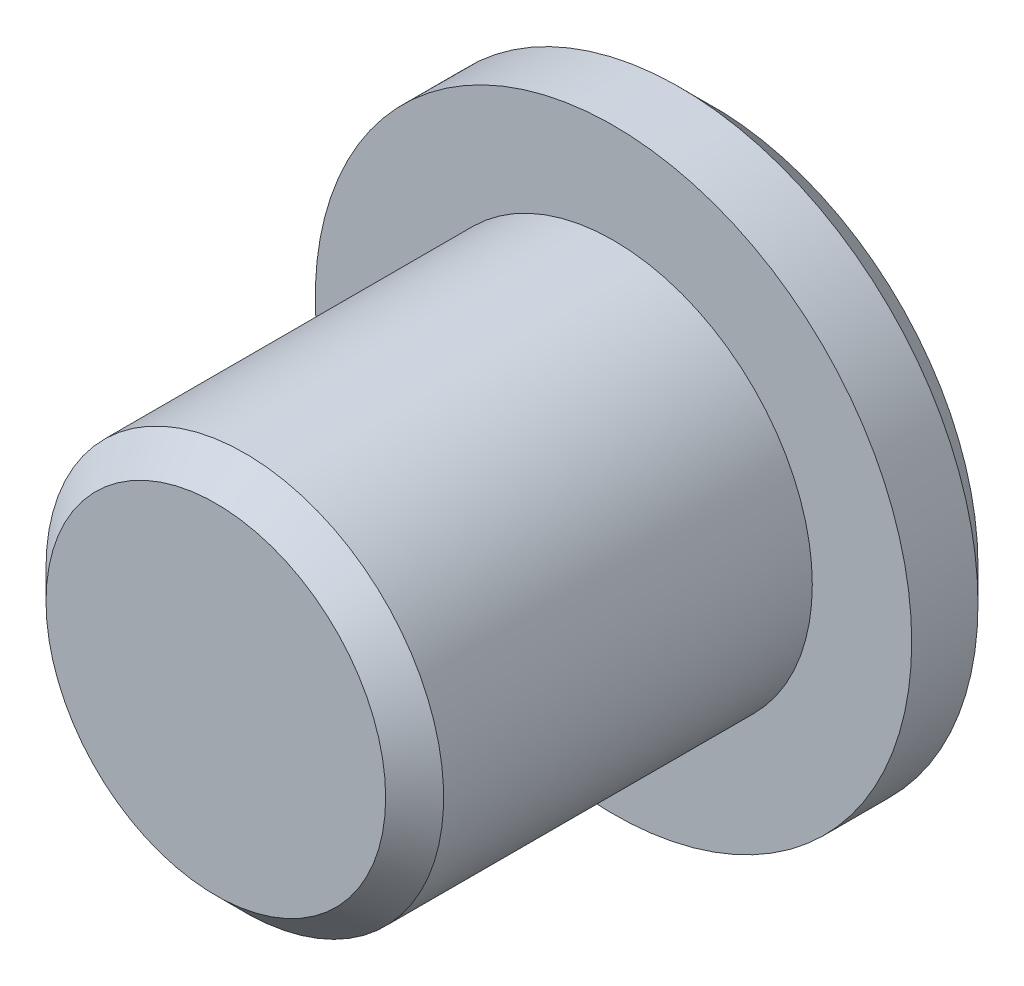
ISO-10303-21;
HEADER;
FILE_DESCRIPTION(('STEP AP214'),'2;1');
FILE_NAME('part.step','',(''),(''),'','','');
FILE_SCHEMA(('AUTOMOTIVE_DESIGN { 1 0 10303 214 1 1 1 1 }'));
ENDSEC;
DATA;
#1=APPLICATION_CONTEXT('core data for automotive mechanical design processes');
#2=APPLICATION_PROTOCOL_DEFINITION('international standard','automotive_design',2000,#1);
#3=PRODUCT_CONTEXT('',#1,'mechanical');
#4=PRODUCT('Part','Part','',(#3));
#5=PRODUCT_RELATED_PRODUCT_CATEGORY('part','',(#4));
#6=PRODUCT_DEFINITION_FORMATION('','',#4);
#7=PRODUCT_DEFINITION_CONTEXT('part definition',#1,'design');
#8=PRODUCT_DEFINITION('design','',#6,#7);
#9=PRODUCT_DEFINITION_SHAPE('','',#8);
#10=(LENGTH_UNIT() NAMED_UNIT(*) SI_UNIT(.MILLI.,.METRE.));
#11=(NAMED_UNIT(*) PLANE_ANGLE_UNIT() SI_UNIT($,.RADIAN.));
#12=(NAMED_UNIT(*) SI_UNIT($,.STERADIAN.) SOLID_ANGLE_UNIT());
#13=UNCERTAINTY_MEASURE_WITH_UNIT(LENGTH_MEASURE(1.E-05),#10,'distance_accuracy_value','');
#14=(GEOMETRIC_REPRESENTATION_CONTEXT(3) GLOBAL_UNCERTAINTY_ASSIGNED_CONTEXT((#13)) GLOBAL_UNIT_ASSIGNED_CONTEXT((#10,
#11,#12)) REPRESENTATION_CONTEXT('',''));
#15=CARTESIAN_POINT('',(0.,0.,0.));
#16=DIRECTION('',(0.,0.,1.));
#17=DIRECTION('',(1.,0.,0.));
#18=AXIS2_PLACEMENT_3D('',#15,#16,#17);
#19=CARTESIAN_POINT('',(0.,0.,0.));
#20=DIRECTION('',(0.,0.,1.));
#21=DIRECTION('',(1.,0.,0.));
#22=AXIS2_PLACEMENT_3D('',#19,#20,#21);
#23=PLANE('',#22);
#24=CARTESIAN_POINT('',(0.,0.,0.));
#25=DIRECTION('',(0.,0.,1.));
#26=DIRECTION('',(1.,0.,0.));
#27=AXIS2_PLACEMENT_3D('',#24,#25,#26);
#28=CIRCLE('',#27,8.);
#29=CARTESIAN_POINT('',(8.,0.,0.));
#30=VERTEX_POINT('',#29);
#31=EDGE_CURVE('E45',#30,#30,#28,.F.);
#32=ORIENTED_EDGE('',*,*,#31,.T.);
#33=EDGE_LOOP('',(#32));
#34=FACE_BOUND('',#33,.T.);
#35=CARTESIAN_POINT('',(0.,0.,0.));
#36=DIRECTION('',(0.,0.,-1.));
#37=DIRECTION('',(-1.,0.,0.));
#38=AXIS2_PLACEMENT_3D('',#35,#36,#37);
#39=CIRCLE('',#38,3.46410161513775);
#40=CARTESIAN_POINT('',(3.46410161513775,0.,0.));
#41=VERTEX_POINT('',#40);
#42=CARTESIAN_POINT('',(1.73205080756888,-3.,0.));
#43=VERTEX_POINT('',#42);
#44=EDGE_CURVE('E152',#41,#43,#39,.T.);
#45=ORIENTED_EDGE('',*,*,#44,.F.);
#46=CARTESIAN_POINT('',(1.73205080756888,3.,0.));
#47=VERTEX_POINT('',#46);
#48=EDGE_CURVE('E151',#47,#41,#39,.T.);
#49=ORIENTED_EDGE('',*,*,#48,.F.);
#50=CARTESIAN_POINT('',(-1.73205080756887,3.,0.));
#51=VERTEX_POINT('',#50);
#52=EDGE_CURVE('E119',#51,#47,#39,.T.);
#53=ORIENTED_EDGE('',*,*,#52,.F.);
#54=CARTESIAN_POINT('',(-3.46410161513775,0.,0.));
#55=VERTEX_POINT('',#54);
#56=EDGE_CURVE('E111',#55,#51,#39,.T.);
#57=ORIENTED_EDGE('',*,*,#56,.F.);
#58=CARTESIAN_POINT('',(-1.73205080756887,-3.,0.));
#59=VERTEX_POINT('',#58);
#60=EDGE_CURVE('E51',#59,#55,#39,.T.);
#61=ORIENTED_EDGE('',*,*,#60,.F.);
#62=EDGE_CURVE('E58',#43,#59,#39,.T.);
#63=ORIENTED_EDGE('',*,*,#62,.F.);
#64=EDGE_LOOP('',(#45,#49,#53,#57,#61,#63));
#65=FACE_BOUND('',#64,.T.);
#66=ADVANCED_FACE('F32',(#34,#65),#23,.F.);
#67=CARTESIAN_POINT('',(0.,0.,3.));
#68=DIRECTION('',(0.,0.,1.));
#69=DIRECTION('',(1.,0.,0.));
#70=AXIS2_PLACEMENT_3D('',#67,#68,#69);
#71=PLANE('',#70);
#72=CARTESIAN_POINT('',(0.,0.,3.));
#73=DIRECTION('',(0.,0.,1.));
#74=DIRECTION('',(1.,0.,0.));
#75=AXIS2_PLACEMENT_3D('',#72,#73,#74);
#76=CIRCLE('',#75,9.);
#77=CARTESIAN_POINT('',(9.,0.,3.));
#78=VERTEX_POINT('',#77);
#79=EDGE_CURVE('E244',#78,#78,#76,.T.);
#80=ORIENTED_EDGE('',*,*,#79,.T.);
#81=EDGE_LOOP('',(#80));
#82=FACE_BOUND('',#81,.T.);
#83=CARTESIAN_POINT('',(0.,0.,3.));
#84=DIRECTION('',(0.,0.,1.));
#85=DIRECTION('',(1.,0.,0.));
#86=AXIS2_PLACEMENT_3D('',#83,#84,#85);
#87=CIRCLE('',#86,6.);
#88=CARTESIAN_POINT('',(6.,0.,3.));
#89=VERTEX_POINT('',#88);
#90=EDGE_CURVE('E249',#89,#89,#87,.T.);
#91=ORIENTED_EDGE('',*,*,#90,.F.);
#92=EDGE_LOOP('',(#91));
#93=FACE_BOUND('',#92,.T.);
#94=ADVANCED_FACE('F211',(#82,#93),#71,.T.);
#95=CARTESIAN_POINT('',(0.,0.,3.));
#96=DIRECTION('',(0.,0.,-1.));
#97=DIRECTION('',(-1.,0.,0.));
#98=AXIS2_PLACEMENT_3D('',#95,#96,#97);
#99=CYLINDRICAL_SURFACE('',#98,9.);
#100=CARTESIAN_POINT('',(0.,0.,0.999999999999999));
#101=DIRECTION('',(0.,0.,1.));
#102=DIRECTION('',(1.,0.,0.));
#103=AXIS2_PLACEMENT_3D('',#100,#101,#102);
#104=CIRCLE('',#103,9.);
#105=CARTESIAN_POINT('',(9.,0.,0.999999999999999));
#106=VERTEX_POINT('',#105);
#107=EDGE_CURVE('E246',#106,#106,#104,.T.);
#108=ORIENTED_EDGE('',*,*,#107,.T.);
#109=EDGE_LOOP('',(#108));
#110=FACE_BOUND('',#109,.T.);
#111=ORIENTED_EDGE('',*,*,#79,.F.);
#112=EDGE_LOOP('',(#111));
#113=FACE_BOUND('',#112,.T.);
#114=ADVANCED_FACE('F217',(#110,#113),#99,.T.);
#115=CARTESIAN_POINT('',(0.,0.,15.));
#116=DIRECTION('',(0.,0.,-1.));
#117=DIRECTION('',(-1.,0.,0.));
#118=AXIS2_PLACEMENT_3D('',#115,#116,#117);
#119=CYLINDRICAL_SURFACE('',#118,6.);
#120=CARTESIAN_POINT('',(0.,0.,14.125));
#121=DIRECTION('',(0.,0.,1.));
#122=DIRECTION('',(1.,0.,0.));
#123=AXIS2_PLACEMENT_3D('',#120,#121,#122);
#124=CIRCLE('',#123,6.);
#125=CARTESIAN_POINT('',(-6.,0.,14.125));
#126=VERTEX_POINT('',#125);
#127=EDGE_CURVE('E240',#126,#126,#124,.F.);
#128=ORIENTED_EDGE('',*,*,#127,.T.);
#129=EDGE_LOOP('',(#128));
#130=FACE_BOUND('',#129,.T.);
#131=ORIENTED_EDGE('',*,*,#90,.T.);
#132=EDGE_LOOP('',(#131));
#133=FACE_BOUND('',#132,.T.);
#134=ADVANCED_FACE('F224',(#130,#133),#119,.T.);
#135=CARTESIAN_POINT('',(0.,0.,15.));
#136=DIRECTION('',(0.,0.,1.));
#137=DIRECTION('',(1.,0.,0.));
#138=AXIS2_PLACEMENT_3D('',#135,#136,#137);
#139=PLANE('',#138);
#140=CARTESIAN_POINT('',(0.,0.,15.));
#141=DIRECTION('',(0.,0.,1.));
#142=DIRECTION('',(1.,0.,0.));
#143=AXIS2_PLACEMENT_3D('',#140,#141,#142);
#144=CIRCLE('',#143,5.125);
#145=CARTESIAN_POINT('',(-5.125,0.,15.));
#146=VERTEX_POINT('',#145);
#147=EDGE_CURVE('E243',#146,#146,#144,.T.);
#148=ORIENTED_EDGE('',*,*,#147,.T.);
#149=EDGE_LOOP('',(#148));
#150=FACE_BOUND('',#149,.T.);
#151=ADVANCED_FACE('F228',(#150),#139,.T.);
#152=CARTESIAN_POINT('',(0.,0.,15.));
#153=DIRECTION('',(0.,0.,-1.));
#154=DIRECTION('',(-1.,0.,0.));
#155=AXIS2_PLACEMENT_3D('',#152,#153,#154);
#156=CONICAL_SURFACE('',#155,5.125,0.785398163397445);
#157=CARTESIAN_POINT('',(-6.,0.,14.125));
#158=CARTESIAN_POINT('',(-5.99088541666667,0.,14.1341145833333));
#159=CARTESIAN_POINT('',(-5.98177083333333,0.,14.1432291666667));
#160=CARTESIAN_POINT('',(-5.96354166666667,0.,14.1614583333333));
#161=CARTESIAN_POINT('',(-5.95442708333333,0.,14.1705729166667));
#162=CARTESIAN_POINT('',(-5.93619791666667,0.,14.1888020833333));
#163=CARTESIAN_POINT('',(-5.92708333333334,0.,14.1979166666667));
#164=CARTESIAN_POINT('',(-5.90885416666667,0.,14.2161458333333));
#165=CARTESIAN_POINT('',(-5.89973958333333,0.,14.2252604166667));
#166=CARTESIAN_POINT('',(-5.88151041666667,0.,14.2434895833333));
#167=CARTESIAN_POINT('',(-5.87239583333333,0.,14.2526041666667));
#168=CARTESIAN_POINT('',(-5.85416666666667,0.,14.2708333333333));
#169=CARTESIAN_POINT('',(-5.84505208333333,0.,14.2799479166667));
#170=CARTESIAN_POINT('',(-5.82682291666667,0.,14.2981770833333));
#171=CARTESIAN_POINT('',(-5.81770833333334,0.,14.3072916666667));
#172=CARTESIAN_POINT('',(-5.79947916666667,0.,14.3255208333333));
#173=CARTESIAN_POINT('',(-5.79036458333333,0.,14.3346354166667));
#174=CARTESIAN_POINT('',(-5.77213541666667,0.,14.3528645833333));
#175=CARTESIAN_POINT('',(-5.76302083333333,0.,14.3619791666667));
#176=CARTESIAN_POINT('',(-5.74479166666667,0.,14.3802083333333));
#177=CARTESIAN_POINT('',(-5.73567708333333,0.,14.3893229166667));
#178=CARTESIAN_POINT('',(-5.71744791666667,0.,14.4075520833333));
#179=CARTESIAN_POINT('',(-5.70833333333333,0.,14.4166666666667));
#180=CARTESIAN_POINT('',(-5.69010416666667,0.,14.4348958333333));
#181=CARTESIAN_POINT('',(-5.68098958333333,0.,14.4440104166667));
#182=CARTESIAN_POINT('',(-5.66276041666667,0.,14.4622395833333));
#183=CARTESIAN_POINT('',(-5.65364583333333,0.,14.4713541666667));
#184=CARTESIAN_POINT('',(-5.63541666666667,0.,14.4895833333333));
#185=CARTESIAN_POINT('',(-5.62630208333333,0.,14.4986979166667));
#186=CARTESIAN_POINT('',(-5.60807291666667,0.,14.5169270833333));
#187=CARTESIAN_POINT('',(-5.59895833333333,0.,14.5260416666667));
#188=CARTESIAN_POINT('',(-5.58072916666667,0.,14.5442708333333));
#189=CARTESIAN_POINT('',(-5.57161458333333,0.,14.5533854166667));
#190=CARTESIAN_POINT('',(-5.55338541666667,0.,14.5716145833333));
#191=CARTESIAN_POINT('',(-5.54427083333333,0.,14.5807291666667));
#192=CARTESIAN_POINT('',(-5.52604166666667,0.,14.5989583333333));
#193=CARTESIAN_POINT('',(-5.51692708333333,0.,14.6080729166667));
#194=CARTESIAN_POINT('',(-5.49869791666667,0.,14.6263020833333));
#195=CARTESIAN_POINT('',(-5.48958333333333,0.,14.6354166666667));
#196=CARTESIAN_POINT('',(-5.47135416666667,0.,14.6536458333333));
#197=CARTESIAN_POINT('',(-5.46223958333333,0.,14.6627604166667));
#198=CARTESIAN_POINT('',(-5.44401041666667,0.,14.6809895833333));
#199=CARTESIAN_POINT('',(-5.43489583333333,0.,14.6901041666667));
#200=CARTESIAN_POINT('',(-5.41666666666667,0.,14.7083333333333));
#201=CARTESIAN_POINT('',(-5.40755208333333,0.,14.7174479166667));
#202=CARTESIAN_POINT('',(-5.38932291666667,0.,14.7356770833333));
#203=CARTESIAN_POINT('',(-5.38020833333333,0.,14.7447916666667));
#204=CARTESIAN_POINT('',(-5.36197916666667,0.,14.7630208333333));
#205=CARTESIAN_POINT('',(-5.35286458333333,0.,14.7721354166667));
#206=CARTESIAN_POINT('',(-5.33463541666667,0.,14.7903645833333));
#207=CARTESIAN_POINT('',(-5.32552083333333,0.,14.7994791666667));
#208=CARTESIAN_POINT('',(-5.30729166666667,0.,14.8177083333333));
#209=CARTESIAN_POINT('',(-5.29817708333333,0.,14.8268229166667));
#210=CARTESIAN_POINT('',(-5.27994791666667,0.,14.8450520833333));
#211=CARTESIAN_POINT('',(-5.27083333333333,0.,14.8541666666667));
#212=CARTESIAN_POINT('',(-5.25260416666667,0.,14.8723958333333));
#213=CARTESIAN_POINT('',(-5.24348958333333,0.,14.8815104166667));
#214=CARTESIAN_POINT('',(-5.22526041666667,0.,14.8997395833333));
#215=CARTESIAN_POINT('',(-5.21614583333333,0.,14.9088541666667));
#216=CARTESIAN_POINT('',(-5.19791666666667,0.,14.9270833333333));
#217=CARTESIAN_POINT('',(-5.18880208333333,0.,14.9361979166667));
#218=CARTESIAN_POINT('',(-5.17057291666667,0.,14.9544270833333));
#219=CARTESIAN_POINT('',(-5.16145833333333,0.,14.9635416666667));
#220=CARTESIAN_POINT('',(-5.14322916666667,0.,14.9817708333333));
#221=CARTESIAN_POINT('',(-5.13411458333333,0.,14.9908854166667));
#222=CARTESIAN_POINT('',(-5.125,0.,15.));
#223=B_SPLINE_CURVE_WITH_KNOTS('',3,(#157,#158,#159,#160,#161,#162,#163,#164,#165,#166,#167,
#168,#169,#170,#171,#172,#173,#174,#175,#176,#177,#178,#179,#180,#181,#182,#183,#184,#185,#186,
#187,#188,#189,#190,#191,#192,#193,#194,#195,#196,#197,#198,#199,#200,#201,#202,#203,#204,#205,
#206,#207,#208,#209,#210,#211,#212,#213,#214,#215,#216,#217,#218,#219,#220,#221,#222),
.UNSPECIFIED.,.F.,.F.,(4,2,2,2,2,2,2,2,2,2,2,2,2,2,2,2,2,2,2,2,2,2,2,2,2,2,2,2,2,2,2,2,4),(0.,
0.0386699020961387,0.0773398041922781,0.116009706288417,0.154679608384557,0.193349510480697,
0.232019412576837,0.270689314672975,0.309359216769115,0.348029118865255,0.386699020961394,
0.425368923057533,0.464038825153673,0.502708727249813,0.541378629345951,0.580048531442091,
0.618718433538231,0.657388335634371,0.69605823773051,0.734728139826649,0.773398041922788,
0.812067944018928,0.850737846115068,0.889407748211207,0.928077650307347,0.966747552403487,
1.00541745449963,1.04408735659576,1.0827572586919,1.12142716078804,1.16009706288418,
1.19876696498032,1.23743686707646),.UNSPECIFIED.);
#224=EDGE_CURVE('BSEAM226',#126,#146,#223,.T.);
#225=ORIENTED_EDGE('',*,*,#127,.F.);
#226=ORIENTED_EDGE('',*,*,#147,.F.);
#227=ORIENTED_EDGE('',*,*,#224,.T.);
#228=ORIENTED_EDGE('',*,*,#224,.F.);
#229=EDGE_LOOP('',(#225,#227,#226,#228));
#230=FACE_BOUND('',#229,.T.);
#231=ADVANCED_FACE('F226',(#230),#156,.T.);
#232=CARTESIAN_POINT('',(0.,0.,0.999999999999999));
#233=DIRECTION('',(0.,0.,1.));
#234=DIRECTION('',(1.,0.,0.));
#235=AXIS2_PLACEMENT_3D('',#232,#233,#234);
#236=CONICAL_SURFACE('',#235,9.,0.78539816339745);
#237=ORIENTED_EDGE('',*,*,#31,.F.);
#238=EDGE_LOOP('',(#237));
#239=FACE_BOUND('',#238,.T.);
#240=ORIENTED_EDGE('',*,*,#107,.F.);
#241=EDGE_LOOP('',(#240));
#242=FACE_BOUND('',#241,.T.);
#243=ADVANCED_FACE('F34',(#239,#242),#236,.T.);
#244=CARTESIAN_POINT('',(0.,0.,3.46410161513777));
#245=DIRECTION('',(0.,0.,-1.));
#246=DIRECTION('',(-1.,0.,0.));
#247=AXIS2_PLACEMENT_3D('',#244,#245,#246);
#248=CONICAL_SURFACE('',#247,0.,0.785398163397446);
#249=CARTESIAN_POINT('',(-3.45441625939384,3.,-1.11115703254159));
#250=CARTESIAN_POINT('',(-3.37030502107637,3.,-1.04766572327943));
#251=CARTESIAN_POINT('',(-3.28572284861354,3.,-0.984788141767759));
#252=CARTESIAN_POINT('',(-3.11543086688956,3.,-0.860535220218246));
#253=CARTESIAN_POINT('',(-3.02972077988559,3.,-0.799160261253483));
#254=CARTESIAN_POINT('',(-2.85636023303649,3.,-0.677750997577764));
#255=CARTESIAN_POINT('',(-2.76869988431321,3.,-0.617730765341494));
#256=CARTESIAN_POINT('',(-2.5918912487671,3.,-0.499930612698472));
#257=CARTESIAN_POINT('',(-2.50274306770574,3.,-0.442150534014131));
#258=CARTESIAN_POINT('',(-2.31756329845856,3.,-0.326095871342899));
#259=CARTESIAN_POINT('',(-2.22143002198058,3.,-0.267982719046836));
#260=CARTESIAN_POINT('',(-2.02694739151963,3.,-0.15559687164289));
#261=CARTESIAN_POINT('',(-1.92859833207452,3.,-0.101323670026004));
#262=CARTESIAN_POINT('',(-1.7296520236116,3.,0.00223755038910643));
#263=CARTESIAN_POINT('',(-1.62906211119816,3.,0.0515395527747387));
#264=CARTESIAN_POINT('',(-1.42513893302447,3.,0.144045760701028));
#265=CARTESIAN_POINT('',(-1.3218069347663,3.,0.187252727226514));
#266=CARTESIAN_POINT('',(-1.12067434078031,3.,0.262860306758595));
#267=CARTESIAN_POINT('',(-1.02309778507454,3.,0.295850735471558));
#268=CARTESIAN_POINT('',(-0.825595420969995,3.,0.354003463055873));
#269=CARTESIAN_POINT('',(-0.725669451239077,3.,0.379165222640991));
#270=CARTESIAN_POINT('',(-0.525726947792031,3.,0.419928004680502));
#271=CARTESIAN_POINT('',(-0.425744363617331,3.,0.435692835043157));
#272=CARTESIAN_POINT('',(-0.224710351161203,3.,0.457355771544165));
#273=CARTESIAN_POINT('',(-0.123659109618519,3.,0.46325557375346));
#274=CARTESIAN_POINT('',(0.0748582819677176,3.,0.464750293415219));
#275=CARTESIAN_POINT('',(0.172321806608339,3.,0.460710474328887));
#276=CARTESIAN_POINT('',(0.366414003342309,3.,0.443354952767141));
#277=CARTESIAN_POINT('',(0.463042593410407,3.,0.430038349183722));
#278=CARTESIAN_POINT('',(0.656399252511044,3.,0.394629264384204));
#279=CARTESIAN_POINT('',(0.753099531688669,3.,0.372387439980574));
#280=CARTESIAN_POINT('',(0.944393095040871,3.,0.320314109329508));
#281=CARTESIAN_POINT('',(1.03898655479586,3.,0.290483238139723));
#282=CARTESIAN_POINT('',(1.2346396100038,3.,0.221388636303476));
#283=CARTESIAN_POINT('',(1.33547771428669,3.,0.181504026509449));
#284=CARTESIAN_POINT('',(1.5345213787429,3.,0.095616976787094));
#285=CARTESIAN_POINT('',(1.63272604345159,3.,0.0496124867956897));
#286=CARTESIAN_POINT('',(1.82700394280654,3.,-0.0474277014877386));
#287=CARTESIAN_POINT('',(1.92306904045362,3.,-0.0984795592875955));
#288=CARTESIAN_POINT('',(2.11298650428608,3.,-0.204482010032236));
#289=CARTESIAN_POINT('',(2.20683926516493,3.,-0.259431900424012));
#290=CARTESIAN_POINT('',(2.38800606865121,3.,-0.369652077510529));
#291=CARTESIAN_POINT('',(2.47541308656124,3.,-0.424770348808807));
#292=CARTESIAN_POINT('',(2.64872655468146,3.,-0.537324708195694));
#293=CARTESIAN_POINT('',(2.73463289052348,3.,-0.594760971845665));
#294=CARTESIAN_POINT('',(2.90444477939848,3.,-0.711062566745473));
#295=CARTESIAN_POINT('',(2.98836091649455,3.,-0.769912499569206));
#296=CARTESIAN_POINT('',(3.15504638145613,3.,-0.889168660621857));
#297=CARTESIAN_POINT('',(3.23781601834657,3.,-0.949574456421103));
#298=CARTESIAN_POINT('',(3.32010556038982,3.,-1.01061635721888));
#299=B_SPLINE_CURVE_WITH_KNOTS('',3,(#249,#250,#251,#252,#253,#254,#255,#256,#257,#258,#259,
#260,#261,#262,#263,#264,#265,#266,#267,#268,#269,#270,#271,#272,#273,#274,#275,#276,#277,#278,
#279,#280,#281,#282,#283,#284,#285,#286,#287,#288,#289,#290,#291,#292,#293,#294,#295,#296,#297,
#298),.UNSPECIFIED.,.F.,.F.,(4,2,2,2,2,2,2,2,2,2,2,2,2,2,2,2,2,2,2,2,2,2,2,2,4),(0.,
0.316159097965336,0.632397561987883,0.951086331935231,1.26975254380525,1.60668135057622,
1.94356563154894,2.27947417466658,2.61523006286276,2.92396665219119,3.23272450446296,
3.5359294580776,3.83908227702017,4.13126225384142,4.42347061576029,4.72078712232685,
5.01807875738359,5.34314370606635,5.668317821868,5.99456896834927,6.32076146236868,
6.630721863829,6.94070578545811,7.24817167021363,7.55555300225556),.UNSPECIFIED.);
#300=EDGE_CURVE('E11',#47,#51,#299,.F.);
#301=ORIENTED_EDGE('',*,*,#300,.T.);
#302=ORIENTED_EDGE('',*,*,#52,.T.);
#303=EDGE_LOOP('',(#301,#302));
#304=FACE_BOUND('',#303,.T.);
#305=ADVANCED_FACE('F124',(#304),#248,.F.);
#306=CARTESIAN_POINT('',(3.46421708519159,-0.000199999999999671,-0.000115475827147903));
#307=CARTESIAN_POINT('',(3.40467869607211,0.102923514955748,0.0593716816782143));
#308=CARTESIAN_POINT('',(3.3441447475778,0.20777138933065,0.115365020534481));
#309=CARTESIAN_POINT('',(3.22070940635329,0.421567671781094,0.217887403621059));
#310=CARTESIAN_POINT('',(3.15779627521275,0.530536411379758,0.26435940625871));
#311=CARTESIAN_POINT('',(3.03093496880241,0.750266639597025,0.343966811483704));
#312=CARTESIAN_POINT('',(2.96701910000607,0.860972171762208,0.377302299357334));
#313=CARTESIAN_POINT('',(2.83778025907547,1.08482041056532,0.428662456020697));
#314=CARTESIAN_POINT('',(2.7724612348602,1.19795627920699,0.4467254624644));
#315=CARTESIAN_POINT('',(2.65988677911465,1.39294095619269,0.463023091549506));
#316=CARTESIAN_POINT('',(2.61277673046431,1.47453795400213,0.465435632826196));
#317=CARTESIAN_POINT('',(2.51863325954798,1.63759922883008,0.46137056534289));
#318=CARTESIAN_POINT('',(2.47159986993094,1.71906344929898,0.454889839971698));
#319=CARTESIAN_POINT('',(2.37797867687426,1.88122011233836,0.433408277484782));
#320=CARTESIAN_POINT('',(2.3313914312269,1.96191158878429,0.418397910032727));
#321=CARTESIAN_POINT('',(2.23901705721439,2.12190869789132,0.380676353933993));
#322=CARTESIAN_POINT('',(2.1932298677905,2.20121443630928,0.357965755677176));
#323=CARTESIAN_POINT('',(2.11194373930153,2.34200614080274,0.311239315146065));
#324=CARTESIAN_POINT('',(2.07626488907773,2.40380372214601,0.288451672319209));
#325=CARTESIAN_POINT('',(2.00554773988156,2.52628941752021,0.23920371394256));
#326=CARTESIAN_POINT('',(1.97050946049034,2.5869774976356,0.212743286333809));
#327=CARTESIAN_POINT('',(1.90118383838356,2.70705299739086,0.156743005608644));
#328=CARTESIAN_POINT('',(1.86689452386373,2.76644383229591,0.127212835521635));
#329=CARTESIAN_POINT('',(1.79895094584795,2.88412556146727,0.0654609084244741));
#330=CARTESIAN_POINT('',(1.76529630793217,2.94241710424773,0.0332408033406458));
#331=CARTESIAN_POINT('',(1.73193533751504,3.0002,-0.000115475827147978));
#332=B_SPLINE_CURVE_WITH_KNOTS('',3,(#306,#307,#308,#309,#310,#311,#312,#313,#314,#315,#316,
#317,#318,#319,#320,#321,#322,#323,#324,#325,#326,#327,#328,#329,#330,#331),.UNSPECIFIED.,.F.,
.F.,(4,2,2,2,2,2,2,2,2,2,2,2,4),(0.,0.399603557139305,0.801535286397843,1.19708369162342,
1.59163620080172,1.87398941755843,2.15644160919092,2.43921001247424,2.72195674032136,
2.94657516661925,3.17120044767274,3.3951375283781,3.61893808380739),.UNSPECIFIED.);
#333=EDGE_CURVE('E118',#41,#47,#332,.T.);
#334=ORIENTED_EDGE('',*,*,#333,.T.);
#335=ORIENTED_EDGE('',*,*,#48,.T.);
#336=EDGE_LOOP('',(#334,#335));
#337=FACE_BOUND('',#336,.T.);
#338=ADVANCED_FACE('F445',(#337),#248,.F.);
#339=CARTESIAN_POINT('',(1.73193533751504,-3.0002,-0.000115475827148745));
#340=CARTESIAN_POINT('',(1.79147372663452,-2.89707648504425,0.0593716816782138));
#341=CARTESIAN_POINT('',(1.85200767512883,-2.79222861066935,0.115365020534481));
#342=CARTESIAN_POINT('',(1.97544301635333,-2.57843232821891,0.217887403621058));
#343=CARTESIAN_POINT('',(2.03835614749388,-2.46946358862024,0.264359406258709));
#344=CARTESIAN_POINT('',(2.16521745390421,-2.24973336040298,0.343966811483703));
#345=CARTESIAN_POINT('',(2.22913332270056,-2.13902782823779,0.377302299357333));
#346=CARTESIAN_POINT('',(2.35837216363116,-1.91517958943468,0.428662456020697));
#347=CARTESIAN_POINT('',(2.42369118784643,-1.80204372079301,0.4467254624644));
#348=CARTESIAN_POINT('',(2.53626564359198,-1.6070590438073,0.463023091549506));
#349=CARTESIAN_POINT('',(2.58337569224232,-1.52546204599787,0.465435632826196));
#350=CARTESIAN_POINT('',(2.67751916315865,-1.36240077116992,0.46137056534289));
#351=CARTESIAN_POINT('',(2.72455255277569,-1.28093655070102,0.454889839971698));
#352=CARTESIAN_POINT('',(2.81817374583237,-1.11877988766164,0.433408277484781));
#353=CARTESIAN_POINT('',(2.86476099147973,-1.03808841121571,0.418397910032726));
#354=CARTESIAN_POINT('',(2.95713536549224,-0.878091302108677,0.380676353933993));
#355=CARTESIAN_POINT('',(3.00292255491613,-0.798785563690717,0.357965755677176));
#356=CARTESIAN_POINT('',(3.0842086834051,-0.65799385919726,0.311239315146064));
#357=CARTESIAN_POINT('',(3.1198875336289,-0.596196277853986,0.288451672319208));
#358=CARTESIAN_POINT('',(3.19060468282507,-0.473710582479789,0.239203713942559));
#359=CARTESIAN_POINT('',(3.22564296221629,-0.413022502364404,0.212743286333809));
#360=CARTESIAN_POINT('',(3.29496858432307,-0.292947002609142,0.156743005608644));
#361=CARTESIAN_POINT('',(3.3292578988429,-0.233556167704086,0.127212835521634));
#362=CARTESIAN_POINT('',(3.39720147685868,-0.115874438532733,0.0654609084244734));
#363=CARTESIAN_POINT('',(3.43085611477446,-0.0575828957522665,0.033240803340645));
#364=CARTESIAN_POINT('',(3.46421708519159,0.00020000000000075,-0.000115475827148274));
#365=B_SPLINE_CURVE_WITH_KNOTS('',3,(#339,#340,#341,#342,#343,#344,#345,#346,#347,#348,#349,
#350,#351,#352,#353,#354,#355,#356,#357,#358,#359,#360,#361,#362,#363,#364),.UNSPECIFIED.,.F.,
.F.,(4,2,2,2,2,2,2,2,2,2,2,2,4),(0.,0.399603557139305,0.801535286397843,1.19708369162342,
1.59163620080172,1.87398941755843,2.15644160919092,2.43921001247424,2.72195674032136,
2.94657516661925,3.17120044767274,3.3951375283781,3.61893808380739),.UNSPECIFIED.);
#366=EDGE_CURVE('E159',#43,#41,#365,.T.);
#367=ORIENTED_EDGE('',*,*,#366,.T.);
#368=ORIENTED_EDGE('',*,*,#44,.T.);
#369=EDGE_LOOP('',(#367,#368));
#370=FACE_BOUND('',#369,.T.);
#371=ADVANCED_FACE('F452',(#370),#248,.F.);
#372=CARTESIAN_POINT('',(-3.45441625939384,-3.,-1.11115703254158));
#373=CARTESIAN_POINT('',(-3.37030502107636,-3.,-1.04766572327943));
#374=CARTESIAN_POINT('',(-3.28572284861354,-3.,-0.984788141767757));
#375=CARTESIAN_POINT('',(-3.11543086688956,-3.,-0.860535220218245));
#376=CARTESIAN_POINT('',(-3.02972077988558,-3.,-0.799160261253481));
#377=CARTESIAN_POINT('',(-2.85636023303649,-3.,-0.677750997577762));
#378=CARTESIAN_POINT('',(-2.76869988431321,-3.,-0.617730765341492));
#379=CARTESIAN_POINT('',(-2.5918912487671,-3.,-0.49993061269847));
#380=CARTESIAN_POINT('',(-2.50274306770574,-3.,-0.44215053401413));
#381=CARTESIAN_POINT('',(-2.31756329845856,-3.,-0.326095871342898));
#382=CARTESIAN_POINT('',(-2.22143002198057,-3.,-0.267982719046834));
#383=CARTESIAN_POINT('',(-2.02694739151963,-3.,-0.155596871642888));
#384=CARTESIAN_POINT('',(-1.92859833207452,-3.,-0.101323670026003));
#385=CARTESIAN_POINT('',(-1.72965202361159,-3.,0.00223755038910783));
#386=CARTESIAN_POINT('',(-1.62906211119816,-3.,0.0515395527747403));
#387=CARTESIAN_POINT('',(-1.42513893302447,-3.,0.14404576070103));
#388=CARTESIAN_POINT('',(-1.3218069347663,-3.,0.187252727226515));
#389=CARTESIAN_POINT('',(-1.12067434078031,-3.,0.262860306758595));
#390=CARTESIAN_POINT('',(-1.02309778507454,-3.,0.295850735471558));
#391=CARTESIAN_POINT('',(-0.825595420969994,-3.,0.354003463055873));
#392=CARTESIAN_POINT('',(-0.725669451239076,-3.,0.379165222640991));
#393=CARTESIAN_POINT('',(-0.52572694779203,-3.,0.419928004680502));
#394=CARTESIAN_POINT('',(-0.425744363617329,-3.,0.435692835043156));
#395=CARTESIAN_POINT('',(-0.224710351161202,-3.,0.457355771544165));
#396=CARTESIAN_POINT('',(-0.123659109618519,-3.,0.46325557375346));
#397=CARTESIAN_POINT('',(0.0748582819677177,-3.,0.464750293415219));
#398=CARTESIAN_POINT('',(0.172321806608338,-3.,0.460710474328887));
#399=CARTESIAN_POINT('',(0.366414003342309,-3.,0.44335495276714));
#400=CARTESIAN_POINT('',(0.463042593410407,-3.,0.430038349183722));
#401=CARTESIAN_POINT('',(0.656399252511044,-3.,0.394629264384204));
#402=CARTESIAN_POINT('',(0.753099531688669,-3.,0.372387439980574));
#403=CARTESIAN_POINT('',(0.944393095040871,-3.,0.320314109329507));
#404=CARTESIAN_POINT('',(1.03898655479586,-3.,0.290483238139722));
#405=CARTESIAN_POINT('',(1.2346396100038,-3.,0.221388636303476));
#406=CARTESIAN_POINT('',(1.3354777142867,-3.,0.181504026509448));
#407=CARTESIAN_POINT('',(1.5345213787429,-3.,0.0956169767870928));
#408=CARTESIAN_POINT('',(1.63272604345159,-3.,0.0496124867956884));
#409=CARTESIAN_POINT('',(1.82700394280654,-3.,-0.0474277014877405));
#410=CARTESIAN_POINT('',(1.92306904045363,-3.,-0.0984795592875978));
#411=CARTESIAN_POINT('',(2.11298650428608,-3.,-0.204482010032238));
#412=CARTESIAN_POINT('',(2.20683926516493,-3.,-0.259431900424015));
#413=CARTESIAN_POINT('',(2.38800606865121,-3.,-0.369652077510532));
#414=CARTESIAN_POINT('',(2.47541308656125,-3.,-0.42477034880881));
#415=CARTESIAN_POINT('',(2.64872655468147,-3.,-0.537324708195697));
#416=CARTESIAN_POINT('',(2.73463289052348,-3.,-0.594760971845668));
#417=CARTESIAN_POINT('',(2.90444477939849,-3.,-0.711062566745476));
#418=CARTESIAN_POINT('',(2.98836091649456,-3.,-0.769912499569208));
#419=CARTESIAN_POINT('',(3.15504638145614,-3.,-0.889168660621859));
#420=CARTESIAN_POINT('',(3.23781601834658,-3.,-0.949574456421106));
#421=CARTESIAN_POINT('',(3.32010556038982,-3.,-1.01061635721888));
#422=B_SPLINE_CURVE_WITH_KNOTS('',3,(#372,#373,#374,#375,#376,#377,#378,#379,#380,#381,#382,
#383,#384,#385,#386,#387,#388,#389,#390,#391,#392,#393,#394,#395,#396,#397,#398,#399,#400,#401,
#402,#403,#404,#405,#406,#407,#408,#409,#410,#411,#412,#413,#414,#415,#416,#417,#418,#419,#420,
#421),.UNSPECIFIED.,.F.,.F.,(4,2,2,2,2,2,2,2,2,2,2,2,2,2,2,2,2,2,2,2,2,2,2,2,4),(0.,
0.316159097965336,0.632397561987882,0.951086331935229,1.26975254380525,1.60668135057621,
1.94356563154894,2.27947417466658,2.61523006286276,2.92396665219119,3.23272450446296,
3.5359294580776,3.83908227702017,4.13126225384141,4.42347061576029,4.72078712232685,
5.01807875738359,5.34314370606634,5.668317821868,5.99456896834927,6.32076146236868,
6.630721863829,6.94070578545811,7.24817167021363,7.55555300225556),.UNSPECIFIED.);
#423=EDGE_CURVE('E179',#59,#43,#422,.T.);
#424=ORIENTED_EDGE('',*,*,#423,.T.);
#425=ORIENTED_EDGE('',*,*,#62,.T.);
#426=EDGE_LOOP('',(#424,#425));
#427=FACE_BOUND('',#426,.T.);
#428=ADVANCED_FACE('F460',(#427),#248,.F.);
#429=CARTESIAN_POINT('',(-3.4642170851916,0.000199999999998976,-0.000115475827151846));
#430=CARTESIAN_POINT('',(-3.40467869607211,-0.102923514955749,0.05937168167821));
#431=CARTESIAN_POINT('',(-3.3441447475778,-0.207771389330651,0.115365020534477));
#432=CARTESIAN_POINT('',(-3.2207094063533,-0.421567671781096,0.217887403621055));
#433=CARTESIAN_POINT('',(-3.15779627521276,-0.530536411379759,0.264359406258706));
#434=CARTESIAN_POINT('',(-3.03093496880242,-0.750266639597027,0.3439668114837));
#435=CARTESIAN_POINT('',(-2.96701910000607,-0.86097217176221,0.37730229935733));
#436=CARTESIAN_POINT('',(-2.83778025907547,-1.08482041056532,0.428662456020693));
#437=CARTESIAN_POINT('',(-2.7724612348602,-1.19795627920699,0.446725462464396));
#438=CARTESIAN_POINT('',(-2.65988677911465,-1.3929409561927,0.463023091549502));
#439=CARTESIAN_POINT('',(-2.61277673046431,-1.47453795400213,0.465435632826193));
#440=CARTESIAN_POINT('',(-2.51863325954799,-1.63759922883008,0.461370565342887));
#441=CARTESIAN_POINT('',(-2.47159986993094,-1.71906344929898,0.454889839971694));
#442=CARTESIAN_POINT('',(-2.37797867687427,-1.88122011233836,0.433408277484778));
#443=CARTESIAN_POINT('',(-2.3313914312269,-1.96191158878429,0.418397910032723));
#444=CARTESIAN_POINT('',(-2.23901705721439,-2.12190869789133,0.38067635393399));
#445=CARTESIAN_POINT('',(-2.1932298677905,-2.20121443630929,0.357965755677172));
#446=CARTESIAN_POINT('',(-2.11194373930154,-2.34200614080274,0.311239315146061));
#447=CARTESIAN_POINT('',(-2.07626488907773,-2.40380372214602,0.288451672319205));
#448=CARTESIAN_POINT('',(-2.00554773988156,-2.52628941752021,0.239203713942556));
#449=CARTESIAN_POINT('',(-1.97050946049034,-2.5869774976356,0.212743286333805));
#450=CARTESIAN_POINT('',(-1.90118383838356,-2.70705299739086,0.15674300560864));
#451=CARTESIAN_POINT('',(-1.86689452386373,-2.76644383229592,0.127212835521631));
#452=CARTESIAN_POINT('',(-1.79895094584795,-2.88412556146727,0.0654609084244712));
#453=CARTESIAN_POINT('',(-1.76529630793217,-2.94241710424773,0.033240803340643));
#454=CARTESIAN_POINT('',(-1.73193533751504,-3.0002,-0.000115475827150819));
#455=B_SPLINE_CURVE_WITH_KNOTS('',3,(#429,#430,#431,#432,#433,#434,#435,#436,#437,#438,#439,
#440,#441,#442,#443,#444,#445,#446,#447,#448,#449,#450,#451,#452,#453,#454),.UNSPECIFIED.,.F.,
.F.,(4,2,2,2,2,2,2,2,2,2,2,2,4),(0.,0.399603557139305,0.801535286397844,1.19708369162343,
1.59163620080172,1.87398941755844,2.15644160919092,2.43921001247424,2.72195674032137,
2.94657516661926,3.17120044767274,3.3951375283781,3.61893808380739),.UNSPECIFIED.);
#456=EDGE_CURVE('E140',#55,#59,#455,.T.);
#457=ORIENTED_EDGE('',*,*,#456,.T.);
#458=ORIENTED_EDGE('',*,*,#60,.T.);
#459=EDGE_LOOP('',(#457,#458));
#460=FACE_BOUND('',#459,.T.);
#461=ADVANCED_FACE('F171',(#460),#248,.F.);
#462=CARTESIAN_POINT('',(-1.73193533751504,3.0002,-0.000115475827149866));
#463=CARTESIAN_POINT('',(-1.79147372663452,2.89707648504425,0.0593716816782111));
#464=CARTESIAN_POINT('',(-1.85200767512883,2.79222861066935,0.115365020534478));
#465=CARTESIAN_POINT('',(-1.97544301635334,2.57843232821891,0.217887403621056));
#466=CARTESIAN_POINT('',(-2.03835614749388,2.46946358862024,0.264359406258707));
#467=CARTESIAN_POINT('',(-2.16521745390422,2.24973336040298,0.343966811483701));
#468=CARTESIAN_POINT('',(-2.22913332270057,2.13902782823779,0.377302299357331));
#469=CARTESIAN_POINT('',(-2.35837216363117,1.91517958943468,0.428662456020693));
#470=CARTESIAN_POINT('',(-2.42369118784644,1.80204372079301,0.446725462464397));
#471=CARTESIAN_POINT('',(-2.53626564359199,1.6070590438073,0.463023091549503));
#472=CARTESIAN_POINT('',(-2.58337569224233,1.52546204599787,0.465435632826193));
#473=CARTESIAN_POINT('',(-2.67751916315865,1.36240077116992,0.461370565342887));
#474=CARTESIAN_POINT('',(-2.72455255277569,1.28093655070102,0.454889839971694));
#475=CARTESIAN_POINT('',(-2.81817374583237,1.11877988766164,0.433408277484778));
#476=CARTESIAN_POINT('',(-2.86476099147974,1.03808841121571,0.418397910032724));
#477=CARTESIAN_POINT('',(-2.95713536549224,0.878091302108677,0.38067635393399));
#478=CARTESIAN_POINT('',(-3.00292255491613,0.798785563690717,0.357965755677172));
#479=CARTESIAN_POINT('',(-3.0842086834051,0.657993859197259,0.311239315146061));
#480=CARTESIAN_POINT('',(-3.11988753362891,0.596196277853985,0.288451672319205));
#481=CARTESIAN_POINT('',(-3.19060468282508,0.473710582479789,0.239203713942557));
#482=CARTESIAN_POINT('',(-3.2256429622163,0.413022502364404,0.212743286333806));
#483=CARTESIAN_POINT('',(-3.29496858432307,0.292947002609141,0.15674300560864));
#484=CARTESIAN_POINT('',(-3.32925789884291,0.233556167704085,0.127212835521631));
#485=CARTESIAN_POINT('',(-3.39720147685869,0.115874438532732,0.0654609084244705));
#486=CARTESIAN_POINT('',(-3.43085611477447,0.057582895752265,0.0332408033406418));
#487=CARTESIAN_POINT('',(-3.4642170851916,-0.00020000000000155,-0.000115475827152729));
#488=B_SPLINE_CURVE_WITH_KNOTS('',3,(#462,#463,#464,#465,#466,#467,#468,#469,#470,#471,#472,
#473,#474,#475,#476,#477,#478,#479,#480,#481,#482,#483,#484,#485,#486,#487),.UNSPECIFIED.,.F.,
.F.,(4,2,2,2,2,2,2,2,2,2,2,2,4),(0.,0.399603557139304,0.801535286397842,1.19708369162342,
1.59163620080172,1.87398941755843,2.15644160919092,2.43921001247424,2.72195674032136,
2.94657516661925,3.17120044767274,3.3951375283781,3.61893808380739),.UNSPECIFIED.);
#489=EDGE_CURVE('E114',#51,#55,#488,.T.);
#490=ORIENTED_EDGE('',*,*,#489,.T.);
#491=ORIENTED_EDGE('',*,*,#56,.T.);
#492=EDGE_LOOP('',(#490,#491));
#493=FACE_BOUND('',#492,.T.);
#494=ADVANCED_FACE('F112',(#493),#248,.F.);
#495=CARTESIAN_POINT('',(0.,0.,6.));
#496=DIRECTION('',(0.,0.,-1.));
#497=DIRECTION('',(-1.,0.,0.));
#498=AXIS2_PLACEMENT_3D('',#495,#496,#497);
#499=CONICAL_SURFACE('',#498,3.,1.02974425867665);
#500=CARTESIAN_POINT('',(0.,0.,7.80258185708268));
#501=VERTEX_POINT('',#500);
#502=VERTEX_LOOP('',#501);
#503=FACE_BOUND('',#502,.T.);
#504=CARTESIAN_POINT('',(0.,0.,6.));
#505=DIRECTION('',(0.,0.,-1.));
#506=DIRECTION('',(-1.,0.,0.));
#507=AXIS2_PLACEMENT_3D('',#504,#505,#506);
#508=CIRCLE('',#507,3.);
#509=CARTESIAN_POINT('',(-2.59807621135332,1.5,6.));
#510=VERTEX_POINT('',#509);
#511=CARTESIAN_POINT('',(0.,3.,6.));
#512=VERTEX_POINT('',#511);
#513=EDGE_CURVE('E263',#510,#512,#508,.T.);
#514=ORIENTED_EDGE('',*,*,#513,.T.);
#515=CARTESIAN_POINT('',(2.59807621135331,1.5,6.));
#516=VERTEX_POINT('',#515);
#517=EDGE_CURVE('E265',#512,#516,#508,.T.);
#518=ORIENTED_EDGE('',*,*,#517,.T.);
#519=CARTESIAN_POINT('',(2.59807621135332,-1.5,6.));
#520=VERTEX_POINT('',#519);
#521=EDGE_CURVE('E309',#516,#520,#508,.T.);
#522=ORIENTED_EDGE('',*,*,#521,.T.);
#523=CARTESIAN_POINT('',(0.,-3.,6.));
#524=VERTEX_POINT('',#523);
#525=EDGE_CURVE('E308',#520,#524,#508,.T.);
#526=ORIENTED_EDGE('',*,*,#525,.T.);
#527=CARTESIAN_POINT('',(-2.59807621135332,-1.5,6.));
#528=VERTEX_POINT('',#527);
#529=EDGE_CURVE('E306',#524,#528,#508,.T.);
#530=ORIENTED_EDGE('',*,*,#529,.T.);
#531=EDGE_CURVE('E267',#528,#510,#508,.T.);
#532=ORIENTED_EDGE('',*,*,#531,.T.);
#533=EDGE_LOOP('',(#514,#518,#522,#526,#530,#532));
#534=FACE_BOUND('',#533,.T.);
#535=ADVANCED_FACE('F170',(#503,#534),#499,.F.);
#536=CARTESIAN_POINT('',(-1.73205080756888,3.,6.));
#537=DIRECTION('',(0.,0.,-1.));
#538=DIRECTION('',(-1.,0.,0.));
#539=AXIS2_PLACEMENT_3D('',#536,#537,#538);
#540=PLANE('',#539);
#541=ORIENTED_EDGE('',*,*,#531,.F.);
#542=DIRECTION('',(-0.5,0.866025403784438,0.));
#543=VECTOR('',#542,1.);
#544=CARTESIAN_POINT('',(-1.73205080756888,-3.,6.));
#545=LINE('',#544,#543);
#546=CARTESIAN_POINT('',(-3.46410161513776,0.,6.));
#547=VERTEX_POINT('',#546);
#548=EDGE_CURVE('E282',#528,#547,#545,.T.);
#549=ORIENTED_EDGE('',*,*,#548,.T.);
#550=DIRECTION('',(0.5,0.866025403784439,0.));
#551=VECTOR('',#550,1.);
#552=CARTESIAN_POINT('',(-3.46410161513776,0.,6.));
#553=LINE('',#552,#551);
#554=EDGE_CURVE('E296',#547,#510,#553,.T.);
#555=ORIENTED_EDGE('',*,*,#554,.T.);
#556=EDGE_LOOP('',(#541,#549,#555));
#557=FACE_BOUND('',#556,.T.);
#558=ADVANCED_FACE('F330',(#557),#540,.T.);
#559=ORIENTED_EDGE('',*,*,#529,.F.);
#560=DIRECTION('',(-1.,0.,0.));
#561=VECTOR('',#560,1.);
#562=CARTESIAN_POINT('',(1.73205080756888,-3.,6.));
#563=LINE('',#562,#561);
#564=CARTESIAN_POINT('',(-1.73205080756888,-3.,6.));
#565=VERTEX_POINT('',#564);
#566=EDGE_CURVE('E286',#524,#565,#563,.T.);
#567=ORIENTED_EDGE('',*,*,#566,.T.);
#568=EDGE_CURVE('E147',#565,#528,#545,.T.);
#569=ORIENTED_EDGE('',*,*,#568,.T.);
#570=EDGE_LOOP('',(#559,#567,#569));
#571=FACE_BOUND('',#570,.T.);
#572=ADVANCED_FACE('F172',(#571),#540,.T.);
#573=ORIENTED_EDGE('',*,*,#525,.F.);
#574=DIRECTION('',(-0.5,-0.866025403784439,0.));
#575=VECTOR('',#574,1.);
#576=CARTESIAN_POINT('',(3.46410161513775,0.,6.));
#577=LINE('',#576,#575);
#578=CARTESIAN_POINT('',(1.73205080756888,-3.,6.));
#579=VERTEX_POINT('',#578);
#580=EDGE_CURVE('E290',#520,#579,#577,.T.);
#581=ORIENTED_EDGE('',*,*,#580,.T.);
#582=EDGE_CURVE('E283',#579,#524,#563,.T.);
#583=ORIENTED_EDGE('',*,*,#582,.T.);
#584=EDGE_LOOP('',(#573,#581,#583));
#585=FACE_BOUND('',#584,.T.);
#586=ADVANCED_FACE('F324',(#585),#540,.T.);
#587=ORIENTED_EDGE('',*,*,#521,.F.);
#588=DIRECTION('',(0.5,-0.866025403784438,0.));
#589=VECTOR('',#588,1.);
#590=CARTESIAN_POINT('',(1.73205080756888,3.,6.));
#591=LINE('',#590,#589);
#592=CARTESIAN_POINT('',(3.46410161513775,0.,6.));
#593=VERTEX_POINT('',#592);
#594=EDGE_CURVE('E294',#516,#593,#591,.T.);
#595=ORIENTED_EDGE('',*,*,#594,.T.);
#596=EDGE_CURVE('E287',#593,#520,#577,.T.);
#597=ORIENTED_EDGE('',*,*,#596,.T.);
#598=EDGE_LOOP('',(#587,#595,#597));
#599=FACE_BOUND('',#598,.T.);
#600=ADVANCED_FACE('F319',(#599),#540,.T.);
#601=ORIENTED_EDGE('',*,*,#513,.F.);
#602=CARTESIAN_POINT('',(-1.73205080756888,3.,6.));
#603=VERTEX_POINT('',#602);
#604=EDGE_CURVE('E139',#510,#603,#553,.T.);
#605=ORIENTED_EDGE('',*,*,#604,.T.);
#606=DIRECTION('',(1.,0.,0.));
#607=VECTOR('',#606,1.);
#608=CARTESIAN_POINT('',(-1.73205080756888,3.,6.));
#609=LINE('',#608,#607);
#610=EDGE_CURVE('E145',#603,#512,#609,.T.);
#611=ORIENTED_EDGE('',*,*,#610,.T.);
#612=EDGE_LOOP('',(#601,#605,#611));
#613=FACE_BOUND('',#612,.T.);
#614=ADVANCED_FACE('F300',(#613),#540,.T.);
#615=ORIENTED_EDGE('',*,*,#517,.F.);
#616=CARTESIAN_POINT('',(1.73205080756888,3.,6.));
#617=VERTEX_POINT('',#616);
#618=EDGE_CURVE('E295',#512,#617,#609,.T.);
#619=ORIENTED_EDGE('',*,*,#618,.T.);
#620=EDGE_CURVE('E291',#617,#516,#591,.T.);
#621=ORIENTED_EDGE('',*,*,#620,.T.);
#622=EDGE_LOOP('',(#615,#619,#621));
#623=FACE_BOUND('',#622,.T.);
#624=ADVANCED_FACE('F312',(#623),#540,.T.);
#625=CARTESIAN_POINT('',(-1.73205080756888,3.,6.));
#626=DIRECTION('',(0.,1.,0.));
#627=DIRECTION('',(0.,0.,1.));
#628=AXIS2_PLACEMENT_3D('',#625,#626,#627);
#629=PLANE('',#628);
#630=ORIENTED_EDGE('',*,*,#300,.F.);
#631=DIRECTION('',(0.,0.,-1.));
#632=VECTOR('',#631,1.);
#633=CARTESIAN_POINT('',(1.73205080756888,3.,6.));
#634=LINE('',#633,#632);
#635=EDGE_CURVE('E146',#617,#47,#634,.T.);
#636=ORIENTED_EDGE('',*,*,#635,.F.);
#637=ORIENTED_EDGE('',*,*,#618,.F.);
#638=ORIENTED_EDGE('',*,*,#610,.F.);
#639=DIRECTION('',(0.,0.,-1.));
#640=VECTOR('',#639,1.);
#641=CARTESIAN_POINT('',(-1.73205080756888,3.,6.));
#642=LINE('',#641,#640);
#643=EDGE_CURVE('E134',#603,#51,#642,.T.);
#644=ORIENTED_EDGE('',*,*,#643,.T.);
#645=EDGE_LOOP('',(#630,#636,#637,#638,#644));
#646=FACE_BOUND('',#645,.T.);
#647=ADVANCED_FACE('F142',(#646),#629,.F.);
#648=CARTESIAN_POINT('',(1.73205080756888,3.,6.));
#649=DIRECTION('',(0.866025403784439,0.5,0.));
#650=DIRECTION('',(-0.5,0.866025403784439,0.));
#651=AXIS2_PLACEMENT_3D('',#648,#649,#650);
#652=PLANE('',#651);
#653=ORIENTED_EDGE('',*,*,#333,.F.);
#654=DIRECTION('',(0.,0.,-1.));
#655=VECTOR('',#654,1.);
#656=CARTESIAN_POINT('',(3.46410161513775,0.,6.));
#657=LINE('',#656,#655);
#658=EDGE_CURVE('E270',#593,#41,#657,.T.);
#659=ORIENTED_EDGE('',*,*,#658,.F.);
#660=ORIENTED_EDGE('',*,*,#594,.F.);
#661=ORIENTED_EDGE('',*,*,#620,.F.);
#662=ORIENTED_EDGE('',*,*,#635,.T.);
#663=EDGE_LOOP('',(#653,#659,#660,#661,#662));
#664=FACE_BOUND('',#663,.T.);
#665=ADVANCED_FACE('F165',(#664),#652,.F.);
#666=CARTESIAN_POINT('',(3.46410161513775,0.,6.));
#667=DIRECTION('',(0.866025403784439,-0.5,0.));
#668=DIRECTION('',(0.5,0.866025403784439,0.));
#669=AXIS2_PLACEMENT_3D('',#666,#667,#668);
#670=PLANE('',#669);
#671=ORIENTED_EDGE('',*,*,#366,.F.);
#672=DIRECTION('',(0.,0.,-1.));
#673=VECTOR('',#672,1.);
#674=CARTESIAN_POINT('',(1.73205080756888,-3.,6.));
#675=LINE('',#674,#673);
#676=EDGE_CURVE('E273',#579,#43,#675,.T.);
#677=ORIENTED_EDGE('',*,*,#676,.F.);
#678=ORIENTED_EDGE('',*,*,#580,.F.);
#679=ORIENTED_EDGE('',*,*,#596,.F.);
#680=ORIENTED_EDGE('',*,*,#658,.T.);
#681=EDGE_LOOP('',(#671,#677,#678,#679,#680));
#682=FACE_BOUND('',#681,.T.);
#683=ADVANCED_FACE('F200',(#682),#670,.F.);
#684=CARTESIAN_POINT('',(1.73205080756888,-3.,6.));
#685=DIRECTION('',(0.,-1.,0.));
#686=DIRECTION('',(0.,0.,-1.));
#687=AXIS2_PLACEMENT_3D('',#684,#685,#686);
#688=PLANE('',#687);
#689=ORIENTED_EDGE('',*,*,#423,.F.);
#690=DIRECTION('',(0.,0.,-1.));
#691=VECTOR('',#690,1.);
#692=CARTESIAN_POINT('',(-1.73205080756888,-3.,6.));
#693=LINE('',#692,#691);
#694=EDGE_CURVE('E276',#565,#59,#693,.T.);
#695=ORIENTED_EDGE('',*,*,#694,.F.);
#696=ORIENTED_EDGE('',*,*,#566,.F.);
#697=ORIENTED_EDGE('',*,*,#582,.F.);
#698=ORIENTED_EDGE('',*,*,#676,.T.);
#699=EDGE_LOOP('',(#689,#695,#696,#697,#698));
#700=FACE_BOUND('',#699,.T.);
#701=ADVANCED_FACE('F196',(#700),#688,.F.);
#702=CARTESIAN_POINT('',(-1.73205080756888,-3.,6.));
#703=DIRECTION('',(-0.866025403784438,-0.5,0.));
#704=DIRECTION('',(0.5,-0.866025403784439,0.));
#705=AXIS2_PLACEMENT_3D('',#702,#703,#704);
#706=PLANE('',#705);
#707=ORIENTED_EDGE('',*,*,#456,.F.);
#708=DIRECTION('',(0.,0.,-1.));
#709=VECTOR('',#708,1.);
#710=CARTESIAN_POINT('',(-3.46410161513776,0.,6.));
#711=LINE('',#710,#709);
#712=EDGE_CURVE('E138',#547,#55,#711,.T.);
#713=ORIENTED_EDGE('',*,*,#712,.F.);
#714=ORIENTED_EDGE('',*,*,#548,.F.);
#715=ORIENTED_EDGE('',*,*,#568,.F.);
#716=ORIENTED_EDGE('',*,*,#694,.T.);
#717=EDGE_LOOP('',(#707,#713,#714,#715,#716));
#718=FACE_BOUND('',#717,.T.);
#719=ADVANCED_FACE('F193',(#718),#706,.F.);
#720=CARTESIAN_POINT('',(-3.46410161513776,0.,6.));
#721=DIRECTION('',(-0.866025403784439,0.5,0.));
#722=DIRECTION('',(-0.5,-0.866025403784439,0.));
#723=AXIS2_PLACEMENT_3D('',#720,#721,#722);
#724=PLANE('',#723);
#725=ORIENTED_EDGE('',*,*,#489,.F.);
#726=ORIENTED_EDGE('',*,*,#643,.F.);
#727=ORIENTED_EDGE('',*,*,#604,.F.);
#728=ORIENTED_EDGE('',*,*,#554,.F.);
#729=ORIENTED_EDGE('',*,*,#712,.T.);
#730=EDGE_LOOP('',(#725,#726,#727,#728,#729));
#731=FACE_BOUND('',#730,.T.);
#732=ADVANCED_FACE('F132',(#731),#724,.F.);
#733=CLOSED_SHELL('',(#66,#94,#114,#134,#151,#231,#243,#305,#338,#371,#428,#461,#494,#535,#558,
#572,#586,#600,#614,#624,#647,#665,#683,#701,#719,#732));
#734=MANIFOLD_SOLID_BREP('B2',#733);
#735=ADVANCED_BREP_SHAPE_REPRESENTATION('',(#18,#734),#14);
#736=SHAPE_DEFINITION_REPRESENTATION(#9,#735);
ENDSEC;
END-ISO-10303-21;
